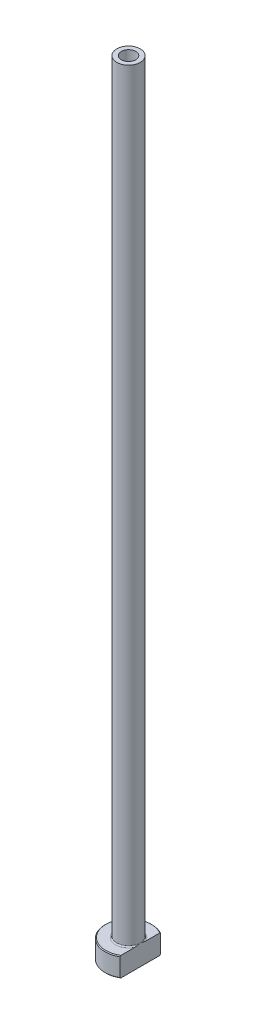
from build123d import *

# Parameters (mm, degrees)
FILLET1_R          = 0.3
CHAMFER1_SIZE      = 0.2
CUT_EXTRUDE1_DEPTH = 201.179919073
CHAMFER2_SIZE      = 0.5


with BuildPart() as part:
    # Sketch1 → Revolve1 (revolve)
    with BuildSketch(Plane.XY, mode=Mode.PRIVATE) as revolve1_sk:
        Polygon((-1.85, 200), (-3, 200), (-3, 5), (-6, 5), (-6, 0), (-2.1, 0), (-2.1, 143), (-1.85, 155), align=None)
    revolve(revolve1_sk.sketch.rotate(Axis((0, 92.187680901, 0), (0, -1, 0)), 270), axis=Axis((0, 92.187680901, 0), (0, -1, 0)))

    # Fillet1
    fillet1_edges = [part.edges().sort_by_distance(p)[0] for p in [
        (0, 5, -3),
    ]]
    fillet(fillet1_edges, radius=FILLET1_R)

    # Chamfer1
    chamfer1_edges = [part.edges().sort_by_distance(p)[0] for p in [
        (0, 0, -6),
        (0, 5, -6),
    ]]
    chamfer(chamfer1_edges, length=CHAMFER1_SIZE)

    # Sketch2 → Cut-Extrude1 (cut, through all)
    with BuildSketch(Plane.XZ):
        with BuildLine():
            Line((3, 5.196152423), (3, -5.196152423))
            ThreePointArc((3, -5.196152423), (6, 0), (3, 5.196152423))
        make_face()
    extrude(amount=-CUT_EXTRUDE1_DEPTH, mode=Mode.SUBTRACT)

    # Chamfer2
    chamfer2_edges = [part.edges().sort_by_distance(p)[0] for p in [
        (0, 0, -2.1),
    ]]
    chamfer(chamfer2_edges, length=CHAMFER2_SIZE)


solid = part.part
